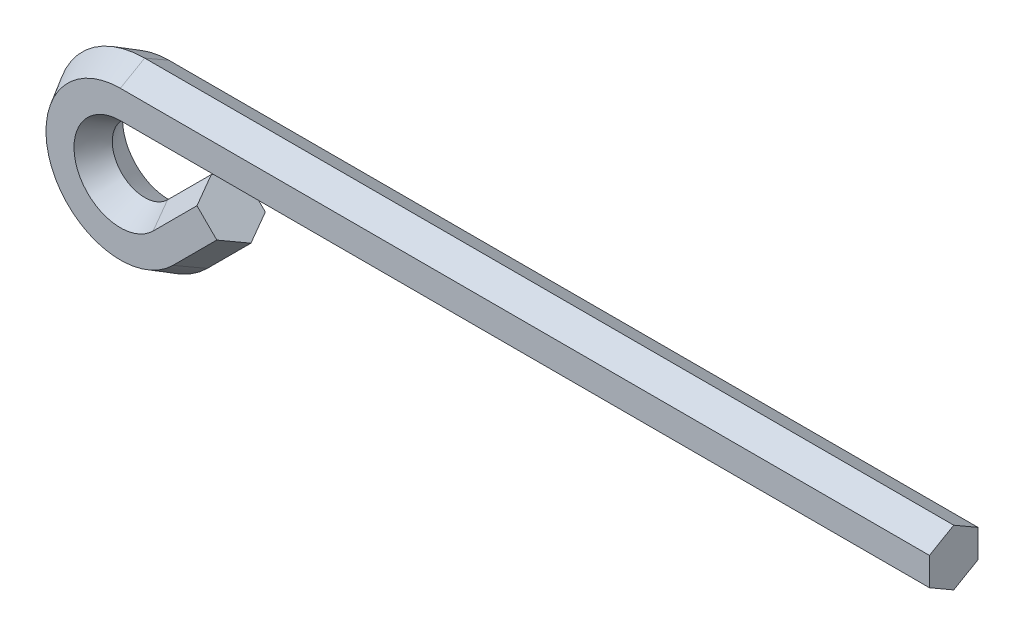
ISO-10303-21;
HEADER;
FILE_DESCRIPTION(('STEP AP214'),'2;1');
FILE_NAME('part.step','',(''),(''),'','','');
FILE_SCHEMA(('AUTOMOTIVE_DESIGN { 1 0 10303 214 1 1 1 1 }'));
ENDSEC;
DATA;
#1=APPLICATION_CONTEXT('core data for automotive mechanical design processes');
#2=APPLICATION_PROTOCOL_DEFINITION('international standard','automotive_design',2000,#1);
#3=PRODUCT_CONTEXT('',#1,'mechanical');
#4=PRODUCT('Part','Part','',(#3));
#5=PRODUCT_RELATED_PRODUCT_CATEGORY('part','',(#4));
#6=PRODUCT_DEFINITION_FORMATION('','',#4);
#7=PRODUCT_DEFINITION_CONTEXT('part definition',#1,'design');
#8=PRODUCT_DEFINITION('design','',#6,#7);
#9=PRODUCT_DEFINITION_SHAPE('','',#8);
#10=(LENGTH_UNIT() NAMED_UNIT(*) SI_UNIT(.MILLI.,.METRE.));
#11=(NAMED_UNIT(*) PLANE_ANGLE_UNIT() SI_UNIT($,.RADIAN.));
#12=(NAMED_UNIT(*) SI_UNIT($,.STERADIAN.) SOLID_ANGLE_UNIT());
#13=UNCERTAINTY_MEASURE_WITH_UNIT(LENGTH_MEASURE(1.E-05),#10,'distance_accuracy_value','');
#14=(GEOMETRIC_REPRESENTATION_CONTEXT(3) GLOBAL_UNCERTAINTY_ASSIGNED_CONTEXT((#13)) GLOBAL_UNIT_ASSIGNED_CONTEXT((#10,
#11,#12)) REPRESENTATION_CONTEXT('',''));
#15=CARTESIAN_POINT('',(0.,0.,0.));
#16=DIRECTION('',(0.,0.,1.));
#17=DIRECTION('',(1.,0.,0.));
#18=AXIS2_PLACEMENT_3D('',#15,#16,#17);
#19=CARTESIAN_POINT('',(6.50266173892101,-6.5026617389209,-3.));
#20=DIRECTION('',(-0.612372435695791,0.612372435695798,0.5));
#21=DIRECTION('',(-0.707106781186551,-0.707106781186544,0.));
#22=AXIS2_PLACEMENT_3D('',#19,#20,#21);
#23=PLANE('',#22);
#24=DIRECTION('',(0.353553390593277,-0.353553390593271,0.866025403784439));
#25=VECTOR('',#24,1.);
#26=CARTESIAN_POINT('',(6.50266173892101,-6.5026617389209,-3.));
#27=LINE('',#26,#25);
#28=CARTESIAN_POINT('',(6.50266173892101,-6.5026617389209,-3.));
#29=VERTEX_POINT('',#28);
#30=CARTESIAN_POINT('',(7.72740661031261,-7.72740661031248,0.));
#31=VERTEX_POINT('',#30);
#32=EDGE_CURVE('E181',#29,#31,#27,.T.);
#33=ORIENTED_EDGE('',*,*,#32,.F.);
#34=DIRECTION('',(0.707106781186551,0.707106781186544,0.));
#35=VECTOR('',#34,1.);
#36=CARTESIAN_POINT('',(6.50266173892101,-6.5026617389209,-3.));
#37=LINE('',#36,#35);
#38=CARTESIAN_POINT('',(11.9168753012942,-1.08844817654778,-3.));
#39=VERTEX_POINT('',#38);
#40=EDGE_CURVE('E35',#29,#39,#37,.T.);
#41=ORIENTED_EDGE('',*,*,#40,.T.);
#42=DIRECTION('',(0.353553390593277,-0.353553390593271,0.866025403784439));
#43=VECTOR('',#42,1.);
#44=CARTESIAN_POINT('',(11.9168753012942,-1.08844817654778,-3.));
#45=LINE('',#44,#43);
#46=CARTESIAN_POINT('',(13.1416201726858,-2.31319304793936,0.));
#47=VERTEX_POINT('',#46);
#48=EDGE_CURVE('E42',#39,#47,#45,.T.);
#49=ORIENTED_EDGE('',*,*,#48,.T.);
#50=DIRECTION('',(0.707106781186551,0.707106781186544,0.));
#51=VECTOR('',#50,1.);
#52=CARTESIAN_POINT('',(7.72740661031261,-7.72740661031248,0.));
#53=LINE('',#52,#51);
#54=EDGE_CURVE('E11',#31,#47,#53,.T.);
#55=ORIENTED_EDGE('',*,*,#54,.F.);
#56=EDGE_LOOP('',(#33,#41,#49,#55));
#57=FACE_BOUND('',#56,.T.);
#58=ADVANCED_FACE('F28',(#57),#23,.F.);
#59=CARTESIAN_POINT('',(2.82842712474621,-2.82842712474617,0.));
#60=DIRECTION('',(0.612372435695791,-0.612372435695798,0.5));
#61=DIRECTION('',(0.707106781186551,0.707106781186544,0.));
#62=AXIS2_PLACEMENT_3D('',#59,#60,#61);
#63=PLANE('',#62);
#64=DIRECTION('',(0.353553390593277,-0.353553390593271,-0.866025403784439));
#65=VECTOR('',#64,1.);
#66=CARTESIAN_POINT('',(2.82842712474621,-2.82842712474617,0.));
#67=LINE('',#66,#65);
#68=CARTESIAN_POINT('',(2.82842712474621,-2.82842712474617,0.));
#69=VERTEX_POINT('',#68);
#70=CARTESIAN_POINT('',(4.05317199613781,-4.05317199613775,-3.));
#71=VERTEX_POINT('',#70);
#72=EDGE_CURVE('E178',#69,#71,#67,.T.);
#73=ORIENTED_EDGE('',*,*,#72,.F.);
#74=DIRECTION('',(0.707106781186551,0.707106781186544,0.));
#75=VECTOR('',#74,1.);
#76=CARTESIAN_POINT('',(2.82842712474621,-2.82842712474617,0.));
#77=LINE('',#76,#75);
#78=CARTESIAN_POINT('',(8.24264068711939,2.58578643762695,0.));
#79=VERTEX_POINT('',#78);
#80=EDGE_CURVE('E220',#69,#79,#77,.T.);
#81=ORIENTED_EDGE('',*,*,#80,.T.);
#82=DIRECTION('',(0.353553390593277,-0.353553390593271,-0.866025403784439));
#83=VECTOR('',#82,1.);
#84=CARTESIAN_POINT('',(8.24264068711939,2.58578643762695,0.));
#85=LINE('',#84,#83);
#86=CARTESIAN_POINT('',(9.46738555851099,1.36104156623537,-3.));
#87=VERTEX_POINT('',#86);
#88=EDGE_CURVE('E210',#79,#87,#85,.T.);
#89=ORIENTED_EDGE('',*,*,#88,.T.);
#90=DIRECTION('',(0.707106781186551,0.707106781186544,0.));
#91=VECTOR('',#90,1.);
#92=CARTESIAN_POINT('',(4.05317199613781,-4.05317199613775,-3.));
#93=LINE('',#92,#91);
#94=EDGE_CURVE('E223',#71,#87,#93,.T.);
#95=ORIENTED_EDGE('',*,*,#94,.F.);
#96=EDGE_LOOP('',(#73,#81,#89,#95));
#97=FACE_BOUND('',#96,.T.);
#98=ADVANCED_FACE('F248',(#97),#63,.F.);
#99=CARTESIAN_POINT('',(2.82842712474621,-2.82842712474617,0.));
#100=DIRECTION('',(-0.612372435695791,0.612372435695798,0.5));
#101=DIRECTION('',(-0.707106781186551,-0.707106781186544,0.));
#102=AXIS2_PLACEMENT_3D('',#99,#100,#101);
#103=PLANE('',#102);
#104=DIRECTION('',(0.353553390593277,-0.353553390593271,0.866025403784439));
#105=VECTOR('',#104,1.);
#106=CARTESIAN_POINT('',(2.82842712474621,-2.82842712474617,0.));
#107=LINE('',#106,#105);
#108=CARTESIAN_POINT('',(4.05317199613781,-4.05317199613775,3.));
#109=VERTEX_POINT('',#108);
#110=EDGE_CURVE('E175',#69,#109,#107,.T.);
#111=ORIENTED_EDGE('',*,*,#110,.T.);
#112=DIRECTION('',(0.707106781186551,0.707106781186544,0.));
#113=VECTOR('',#112,1.);
#114=CARTESIAN_POINT('',(4.05317199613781,-4.05317199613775,3.));
#115=LINE('',#114,#113);
#116=CARTESIAN_POINT('',(9.46738555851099,1.36104156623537,3.));
#117=VERTEX_POINT('',#116);
#118=EDGE_CURVE('E217',#109,#117,#115,.T.);
#119=ORIENTED_EDGE('',*,*,#118,.T.);
#120=DIRECTION('',(0.353553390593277,-0.353553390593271,0.866025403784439));
#121=VECTOR('',#120,1.);
#122=CARTESIAN_POINT('',(8.24264068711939,2.58578643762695,0.));
#123=LINE('',#122,#121);
#124=EDGE_CURVE('E207',#79,#117,#123,.T.);
#125=ORIENTED_EDGE('',*,*,#124,.F.);
#126=ORIENTED_EDGE('',*,*,#80,.F.);
#127=EDGE_LOOP('',(#111,#119,#125,#126));
#128=FACE_BOUND('',#127,.T.);
#129=ADVANCED_FACE('F252',(#128),#103,.T.);
#130=CARTESIAN_POINT('',(6.50266173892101,-6.5026617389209,3.));
#131=DIRECTION('',(0.612372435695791,-0.612372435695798,0.5));
#132=DIRECTION('',(0.707106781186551,0.707106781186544,0.));
#133=AXIS2_PLACEMENT_3D('',#130,#131,#132);
#134=PLANE('',#133);
#135=DIRECTION('',(0.353553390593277,-0.353553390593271,-0.866025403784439));
#136=VECTOR('',#135,1.);
#137=CARTESIAN_POINT('',(6.50266173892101,-6.5026617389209,3.));
#138=LINE('',#137,#136);
#139=CARTESIAN_POINT('',(6.50266173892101,-6.5026617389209,3.));
#140=VERTEX_POINT('',#139);
#141=EDGE_CURVE('E129',#140,#31,#138,.T.);
#142=ORIENTED_EDGE('',*,*,#141,.T.);
#143=ORIENTED_EDGE('',*,*,#54,.T.);
#144=DIRECTION('',(0.353553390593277,-0.353553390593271,-0.866025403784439));
#145=VECTOR('',#144,1.);
#146=CARTESIAN_POINT('',(11.9168753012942,-1.08844817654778,3.));
#147=LINE('',#146,#145);
#148=CARTESIAN_POINT('',(11.9168753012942,-1.08844817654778,3.));
#149=VERTEX_POINT('',#148);
#150=EDGE_CURVE('E202',#149,#47,#147,.T.);
#151=ORIENTED_EDGE('',*,*,#150,.F.);
#152=DIRECTION('',(0.707106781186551,0.707106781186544,0.));
#153=VECTOR('',#152,1.);
#154=CARTESIAN_POINT('',(6.50266173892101,-6.5026617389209,3.));
#155=LINE('',#154,#153);
#156=EDGE_CURVE('E214',#140,#149,#155,.T.);
#157=ORIENTED_EDGE('',*,*,#156,.F.);
#158=EDGE_LOOP('',(#142,#143,#151,#157));
#159=FACE_BOUND('',#158,.T.);
#160=ADVANCED_FACE('F257',(#159),#134,.T.);
#161=CARTESIAN_POINT('',(0.,0.,-3.));
#162=DIRECTION('',(0.,0.,1.));
#163=DIRECTION('',(1.,0.,0.));
#164=AXIS2_PLACEMENT_3D('',#161,#162,#163);
#165=CONICAL_SURFACE('',#164,9.19615242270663,0.523598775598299);
#166=DIRECTION('',(0.,0.5,0.866025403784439));
#167=VECTOR('',#166,1.);
#168=CARTESIAN_POINT('',(0.,9.19615242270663,-3.));
#169=LINE('',#168,#167);
#170=CARTESIAN_POINT('',(0.,9.19615242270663,-3.));
#171=VERTEX_POINT('',#170);
#172=CARTESIAN_POINT('',(0.,10.9282032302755,0.));
#173=VERTEX_POINT('',#172);
#174=EDGE_CURVE('E126',#171,#173,#169,.T.);
#175=ORIENTED_EDGE('',*,*,#174,.F.);
#176=CARTESIAN_POINT('',(0.,0.,-3.));
#177=DIRECTION('',(0.,0.,1.));
#178=DIRECTION('',(1.,0.,0.));
#179=AXIS2_PLACEMENT_3D('',#176,#177,#178);
#180=CIRCLE('',#179,9.19615242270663);
#181=EDGE_CURVE('E196',#171,#29,#180,.T.);
#182=ORIENTED_EDGE('',*,*,#181,.T.);
#183=ORIENTED_EDGE('',*,*,#32,.T.);
#184=CARTESIAN_POINT('',(0.,0.,0.));
#185=DIRECTION('',(0.,0.,1.));
#186=DIRECTION('',(1.,0.,0.));
#187=AXIS2_PLACEMENT_3D('',#184,#185,#186);
#188=CIRCLE('',#187,10.9282032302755);
#189=EDGE_CURVE('E199',#173,#31,#188,.T.);
#190=ORIENTED_EDGE('',*,*,#189,.F.);
#191=EDGE_LOOP('',(#175,#182,#183,#190));
#192=FACE_BOUND('',#191,.T.);
#193=ADVANCED_FACE('F227',(#192),#165,.T.);
#194=CARTESIAN_POINT('',(0.,0.,0.));
#195=DIRECTION('',(0.,0.,-1.));
#196=DIRECTION('',(-1.,0.,0.));
#197=AXIS2_PLACEMENT_3D('',#194,#195,#196);
#198=CONICAL_SURFACE('',#197,4.,0.523598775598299);
#199=DIRECTION('',(0.,0.5,-0.866025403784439));
#200=VECTOR('',#199,1.);
#201=CARTESIAN_POINT('',(0.,4.,0.));
#202=LINE('',#201,#200);
#203=CARTESIAN_POINT('',(0.,4.,0.));
#204=VERTEX_POINT('',#203);
#205=CARTESIAN_POINT('',(0.,5.73205080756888,-3.));
#206=VERTEX_POINT('',#205);
#207=EDGE_CURVE('E158',#204,#206,#202,.T.);
#208=ORIENTED_EDGE('',*,*,#207,.F.);
#209=CARTESIAN_POINT('',(0.,0.,0.));
#210=DIRECTION('',(0.,0.,1.));
#211=DIRECTION('',(1.,0.,0.));
#212=AXIS2_PLACEMENT_3D('',#209,#210,#211);
#213=CIRCLE('',#212,4.);
#214=EDGE_CURVE('E190',#204,#69,#213,.T.);
#215=ORIENTED_EDGE('',*,*,#214,.T.);
#216=ORIENTED_EDGE('',*,*,#72,.T.);
#217=CARTESIAN_POINT('',(0.,0.,-3.));
#218=DIRECTION('',(0.,0.,1.));
#219=DIRECTION('',(1.,0.,0.));
#220=AXIS2_PLACEMENT_3D('',#217,#218,#219);
#221=CIRCLE('',#220,5.73205080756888);
#222=EDGE_CURVE('E193',#206,#71,#221,.T.);
#223=ORIENTED_EDGE('',*,*,#222,.F.);
#224=EDGE_LOOP('',(#208,#215,#216,#223));
#225=FACE_BOUND('',#224,.T.);
#226=ADVANCED_FACE('F244',(#225),#198,.F.);
#227=CARTESIAN_POINT('',(0.,0.,0.));
#228=DIRECTION('',(0.,0.,1.));
#229=DIRECTION('',(1.,0.,0.));
#230=AXIS2_PLACEMENT_3D('',#227,#228,#229);
#231=CONICAL_SURFACE('',#230,4.,0.523598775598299);
#232=DIRECTION('',(0.,0.5,0.866025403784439));
#233=VECTOR('',#232,1.);
#234=CARTESIAN_POINT('',(0.,4.,0.));
#235=LINE('',#234,#233);
#236=CARTESIAN_POINT('',(0.,5.73205080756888,3.));
#237=VERTEX_POINT('',#236);
#238=EDGE_CURVE('E161',#204,#237,#235,.T.);
#239=ORIENTED_EDGE('',*,*,#238,.T.);
#240=CARTESIAN_POINT('',(0.,0.,3.));
#241=DIRECTION('',(0.,0.,1.));
#242=DIRECTION('',(1.,0.,0.));
#243=AXIS2_PLACEMENT_3D('',#240,#241,#242);
#244=CIRCLE('',#243,5.73205080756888);
#245=EDGE_CURVE('E187',#237,#109,#244,.T.);
#246=ORIENTED_EDGE('',*,*,#245,.T.);
#247=ORIENTED_EDGE('',*,*,#110,.F.);
#248=ORIENTED_EDGE('',*,*,#214,.F.);
#249=EDGE_LOOP('',(#239,#246,#247,#248));
#250=FACE_BOUND('',#249,.T.);
#251=ADVANCED_FACE('F250',(#250),#231,.F.);
#252=CARTESIAN_POINT('',(0.,0.,3.));
#253=DIRECTION('',(0.,0.,-1.));
#254=DIRECTION('',(-1.,0.,0.));
#255=AXIS2_PLACEMENT_3D('',#252,#253,#254);
#256=CONICAL_SURFACE('',#255,9.19615242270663,0.523598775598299);
#257=DIRECTION('',(0.,0.5,-0.866025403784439));
#258=VECTOR('',#257,1.);
#259=CARTESIAN_POINT('',(0.,9.19615242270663,3.));
#260=LINE('',#259,#258);
#261=CARTESIAN_POINT('',(0.,9.19615242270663,3.));
#262=VERTEX_POINT('',#261);
#263=EDGE_CURVE('E154',#262,#173,#260,.T.);
#264=ORIENTED_EDGE('',*,*,#263,.T.);
#265=ORIENTED_EDGE('',*,*,#189,.T.);
#266=ORIENTED_EDGE('',*,*,#141,.F.);
#267=CARTESIAN_POINT('',(0.,0.,3.));
#268=DIRECTION('',(0.,0.,1.));
#269=DIRECTION('',(1.,0.,0.));
#270=AXIS2_PLACEMENT_3D('',#267,#268,#269);
#271=CIRCLE('',#270,9.19615242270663);
#272=EDGE_CURVE('E184',#262,#140,#271,.T.);
#273=ORIENTED_EDGE('',*,*,#272,.F.);
#274=EDGE_LOOP('',(#264,#265,#266,#273));
#275=FACE_BOUND('',#274,.T.);
#276=ADVANCED_FACE('F230',(#275),#256,.T.);
#277=CARTESIAN_POINT('',(0.,9.19615242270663,3.));
#278=DIRECTION('',(0.,-0.866025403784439,-0.5));
#279=DIRECTION('',(0.,0.5,-0.866025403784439));
#280=AXIS2_PLACEMENT_3D('',#277,#278,#279);
#281=PLANE('',#280);
#282=DIRECTION('',(0.,0.5,-0.866025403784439));
#283=VECTOR('',#282,1.);
#284=CARTESIAN_POINT('',(100.,9.19615242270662,3.));
#285=LINE('',#284,#283);
#286=CARTESIAN_POINT('',(100.,9.19615242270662,3.));
#287=VERTEX_POINT('',#286);
#288=CARTESIAN_POINT('',(100.,10.9282032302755,0.));
#289=VERTEX_POINT('',#288);
#290=EDGE_CURVE('E134',#287,#289,#285,.T.);
#291=ORIENTED_EDGE('',*,*,#290,.T.);
#292=DIRECTION('',(1.,0.,0.));
#293=VECTOR('',#292,1.);
#294=CARTESIAN_POINT('',(0.,10.9282032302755,0.));
#295=LINE('',#294,#293);
#296=EDGE_CURVE('E118',#173,#289,#295,.T.);
#297=ORIENTED_EDGE('',*,*,#296,.F.);
#298=ORIENTED_EDGE('',*,*,#263,.F.);
#299=DIRECTION('',(1.,0.,0.));
#300=VECTOR('',#299,1.);
#301=CARTESIAN_POINT('',(0.,9.19615242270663,3.));
#302=LINE('',#301,#300);
#303=EDGE_CURVE('E137',#262,#287,#302,.T.);
#304=ORIENTED_EDGE('',*,*,#303,.T.);
#305=EDGE_LOOP('',(#291,#297,#298,#304));
#306=FACE_BOUND('',#305,.T.);
#307=ADVANCED_FACE('F135',(#306),#281,.F.);
#308=CARTESIAN_POINT('',(0.,9.19615242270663,-3.));
#309=DIRECTION('',(0.,0.866025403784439,-0.5));
#310=DIRECTION('',(0.,0.5,0.866025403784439));
#311=AXIS2_PLACEMENT_3D('',#308,#309,#310);
#312=PLANE('',#311);
#313=DIRECTION('',(0.,0.5,0.866025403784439));
#314=VECTOR('',#313,1.);
#315=CARTESIAN_POINT('',(100.,9.19615242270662,-3.));
#316=LINE('',#315,#314);
#317=CARTESIAN_POINT('',(100.,9.19615242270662,-3.));
#318=VERTEX_POINT('',#317);
#319=EDGE_CURVE('E123',#318,#289,#316,.T.);
#320=ORIENTED_EDGE('',*,*,#319,.F.);
#321=DIRECTION('',(1.,0.,0.));
#322=VECTOR('',#321,1.);
#323=CARTESIAN_POINT('',(0.,9.19615242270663,-3.));
#324=LINE('',#323,#322);
#325=EDGE_CURVE('E130',#171,#318,#324,.T.);
#326=ORIENTED_EDGE('',*,*,#325,.F.);
#327=ORIENTED_EDGE('',*,*,#174,.T.);
#328=ORIENTED_EDGE('',*,*,#296,.T.);
#329=EDGE_LOOP('',(#320,#326,#327,#328));
#330=FACE_BOUND('',#329,.T.);
#331=ADVANCED_FACE('F120',(#330),#312,.T.);
#332=CARTESIAN_POINT('',(0.,5.73205080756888,-3.));
#333=DIRECTION('',(0.,0.,-1.));
#334=DIRECTION('',(-1.,0.,0.));
#335=AXIS2_PLACEMENT_3D('',#332,#333,#334);
#336=PLANE('',#335);
#337=DIRECTION('',(0.,1.,0.));
#338=VECTOR('',#337,1.);
#339=CARTESIAN_POINT('',(100.,5.73205080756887,-3.));
#340=LINE('',#339,#338);
#341=CARTESIAN_POINT('',(100.,5.73205080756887,-3.));
#342=VERTEX_POINT('',#341);
#343=EDGE_CURVE('E144',#342,#318,#340,.T.);
#344=ORIENTED_EDGE('',*,*,#343,.F.);
#345=DIRECTION('',(1.,0.,0.));
#346=VECTOR('',#345,1.);
#347=CARTESIAN_POINT('',(0.,5.73205080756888,-3.));
#348=LINE('',#347,#346);
#349=EDGE_CURVE('E170',#206,#342,#348,.T.);
#350=ORIENTED_EDGE('',*,*,#349,.F.);
#351=ORIENTED_EDGE('',*,*,#222,.T.);
#352=ORIENTED_EDGE('',*,*,#94,.T.);
#353=DIRECTION('',(0.707106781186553,-0.707106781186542,0.));
#354=VECTOR('',#353,1.);
#355=CARTESIAN_POINT('',(9.46738555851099,1.36104156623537,-3.));
#356=LINE('',#355,#354);
#357=EDGE_CURVE('E50',#87,#39,#356,.T.);
#358=ORIENTED_EDGE('',*,*,#357,.T.);
#359=ORIENTED_EDGE('',*,*,#40,.F.);
#360=ORIENTED_EDGE('',*,*,#181,.F.);
#361=ORIENTED_EDGE('',*,*,#325,.T.);
#362=EDGE_LOOP('',(#344,#350,#351,#352,#358,#359,#360,#361));
#363=FACE_BOUND('',#362,.T.);
#364=ADVANCED_FACE('F225',(#363),#336,.T.);
#365=CARTESIAN_POINT('',(0.,4.,0.));
#366=DIRECTION('',(0.,-0.866025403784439,-0.5));
#367=DIRECTION('',(0.,0.5,-0.866025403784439));
#368=AXIS2_PLACEMENT_3D('',#365,#366,#367);
#369=PLANE('',#368);
#370=DIRECTION('',(0.,0.5,-0.866025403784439));
#371=VECTOR('',#370,1.);
#372=CARTESIAN_POINT('',(100.,3.99999999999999,0.));
#373=LINE('',#372,#371);
#374=CARTESIAN_POINT('',(100.,3.99999999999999,0.));
#375=VERTEX_POINT('',#374);
#376=EDGE_CURVE('E146',#375,#342,#373,.T.);
#377=ORIENTED_EDGE('',*,*,#376,.F.);
#378=DIRECTION('',(1.,0.,0.));
#379=VECTOR('',#378,1.);
#380=CARTESIAN_POINT('',(0.,4.,0.));
#381=LINE('',#380,#379);
#382=EDGE_CURVE('E168',#204,#375,#381,.T.);
#383=ORIENTED_EDGE('',*,*,#382,.F.);
#384=ORIENTED_EDGE('',*,*,#207,.T.);
#385=ORIENTED_EDGE('',*,*,#349,.T.);
#386=EDGE_LOOP('',(#377,#383,#384,#385));
#387=FACE_BOUND('',#386,.T.);
#388=ADVANCED_FACE('F239',(#387),#369,.T.);
#389=CARTESIAN_POINT('',(0.,4.,0.));
#390=DIRECTION('',(0.,0.866025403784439,-0.5));
#391=DIRECTION('',(0.,0.5,0.866025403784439));
#392=AXIS2_PLACEMENT_3D('',#389,#390,#391);
#393=PLANE('',#392);
#394=DIRECTION('',(0.,0.5,0.866025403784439));
#395=VECTOR('',#394,1.);
#396=CARTESIAN_POINT('',(100.,3.99999999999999,0.));
#397=LINE('',#396,#395);
#398=CARTESIAN_POINT('',(100.,5.73205080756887,3.));
#399=VERTEX_POINT('',#398);
#400=EDGE_CURVE('E150',#375,#399,#397,.T.);
#401=ORIENTED_EDGE('',*,*,#400,.T.);
#402=DIRECTION('',(1.,0.,0.));
#403=VECTOR('',#402,1.);
#404=CARTESIAN_POINT('',(0.,5.73205080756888,3.));
#405=LINE('',#404,#403);
#406=EDGE_CURVE('E165',#237,#399,#405,.T.);
#407=ORIENTED_EDGE('',*,*,#406,.F.);
#408=ORIENTED_EDGE('',*,*,#238,.F.);
#409=ORIENTED_EDGE('',*,*,#382,.T.);
#410=EDGE_LOOP('',(#401,#407,#408,#409));
#411=FACE_BOUND('',#410,.T.);
#412=ADVANCED_FACE('F258',(#411),#393,.F.);
#413=CARTESIAN_POINT('',(0.,5.73205080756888,3.));
#414=DIRECTION('',(0.,0.,-1.));
#415=DIRECTION('',(-1.,0.,0.));
#416=AXIS2_PLACEMENT_3D('',#413,#414,#415);
#417=PLANE('',#416);
#418=DIRECTION('',(0.,1.,0.));
#419=VECTOR('',#418,1.);
#420=CARTESIAN_POINT('',(100.,5.73205080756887,3.));
#421=LINE('',#420,#419);
#422=EDGE_CURVE('E152',#399,#287,#421,.T.);
#423=ORIENTED_EDGE('',*,*,#422,.T.);
#424=ORIENTED_EDGE('',*,*,#303,.F.);
#425=ORIENTED_EDGE('',*,*,#272,.T.);
#426=ORIENTED_EDGE('',*,*,#156,.T.);
#427=DIRECTION('',(0.707106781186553,-0.707106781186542,0.));
#428=VECTOR('',#427,1.);
#429=CARTESIAN_POINT('',(9.46738555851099,1.36104156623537,3.));
#430=LINE('',#429,#428);
#431=EDGE_CURVE('E204',#117,#149,#430,.T.);
#432=ORIENTED_EDGE('',*,*,#431,.F.);
#433=ORIENTED_EDGE('',*,*,#118,.F.);
#434=ORIENTED_EDGE('',*,*,#245,.F.);
#435=ORIENTED_EDGE('',*,*,#406,.T.);
#436=EDGE_LOOP('',(#423,#424,#425,#426,#432,#433,#434,#435));
#437=FACE_BOUND('',#436,.T.);
#438=ADVANCED_FACE('F232',(#437),#417,.F.);
#439=CARTESIAN_POINT('',(14.3663650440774,-3.53793791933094,-3.));
#440=DIRECTION('',(-0.707106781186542,-0.707106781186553,0.));
#441=DIRECTION('',(0.,0.,-1.));
#442=AXIS2_PLACEMENT_3D('',#439,#440,#441);
#443=PLANE('',#442);
#444=ORIENTED_EDGE('',*,*,#150,.T.);
#445=ORIENTED_EDGE('',*,*,#48,.F.);
#446=ORIENTED_EDGE('',*,*,#357,.F.);
#447=ORIENTED_EDGE('',*,*,#88,.F.);
#448=ORIENTED_EDGE('',*,*,#124,.T.);
#449=ORIENTED_EDGE('',*,*,#431,.T.);
#450=EDGE_LOOP('',(#444,#445,#446,#447,#448,#449));
#451=FACE_BOUND('',#450,.T.);
#452=ADVANCED_FACE('F255',(#451),#443,.F.);
#453=CARTESIAN_POINT('',(100.,12.6602540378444,-3.));
#454=DIRECTION('',(1.,0.,0.));
#455=DIRECTION('',(0.,0.,-1.));
#456=AXIS2_PLACEMENT_3D('',#453,#454,#455);
#457=PLANE('',#456);
#458=ORIENTED_EDGE('',*,*,#290,.F.);
#459=ORIENTED_EDGE('',*,*,#422,.F.);
#460=ORIENTED_EDGE('',*,*,#400,.F.);
#461=ORIENTED_EDGE('',*,*,#376,.T.);
#462=ORIENTED_EDGE('',*,*,#343,.T.);
#463=ORIENTED_EDGE('',*,*,#319,.T.);
#464=EDGE_LOOP('',(#458,#459,#460,#461,#462,#463));
#465=FACE_BOUND('',#464,.T.);
#466=ADVANCED_FACE('F141',(#465),#457,.T.);
#467=CLOSED_SHELL('',(#58,#98,#129,#160,#193,#226,#251,#276,#307,#331,#364,#388,#412,#438,#452,#466));
#468=MANIFOLD_SOLID_BREP('B2',#467);
#469=ADVANCED_BREP_SHAPE_REPRESENTATION('',(#18,#468),#14);
#470=SHAPE_DEFINITION_REPRESENTATION(#9,#469);
ENDSEC;
END-ISO-10303-21;
